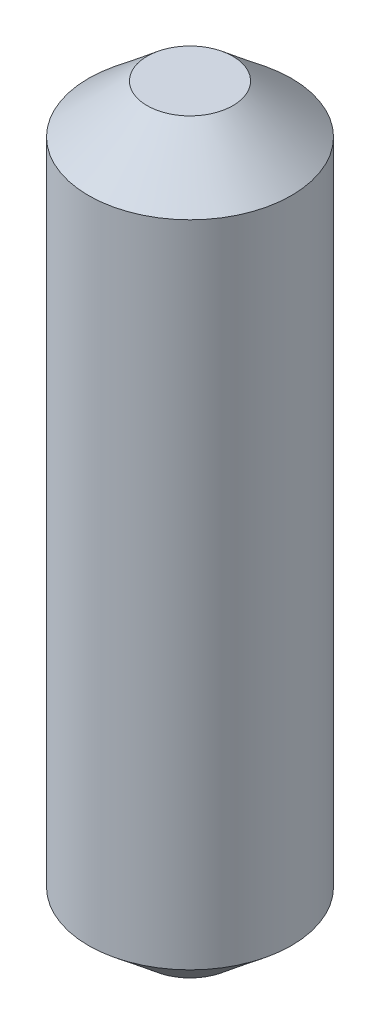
from build123d import *


with BuildPart() as part:
    # Sketch1 → Revolve1 (revolve)
    with BuildSketch(Plane.XY, mode=Mode.PRIVATE) as revolve1_sk:
        Polygon((0, 0), (0.4826, 0), (1.143, 0.5461), (1.143, 7.8613), (0.4826, 8.4074), (0, 8.4074), align=None)
    revolve(revolve1_sk.sketch.rotate(Axis((0, 0, 0), (0, 1, 0)), 90), axis=Axis((0, 0, 0), (0, 1, 0)))


solid = part.part
